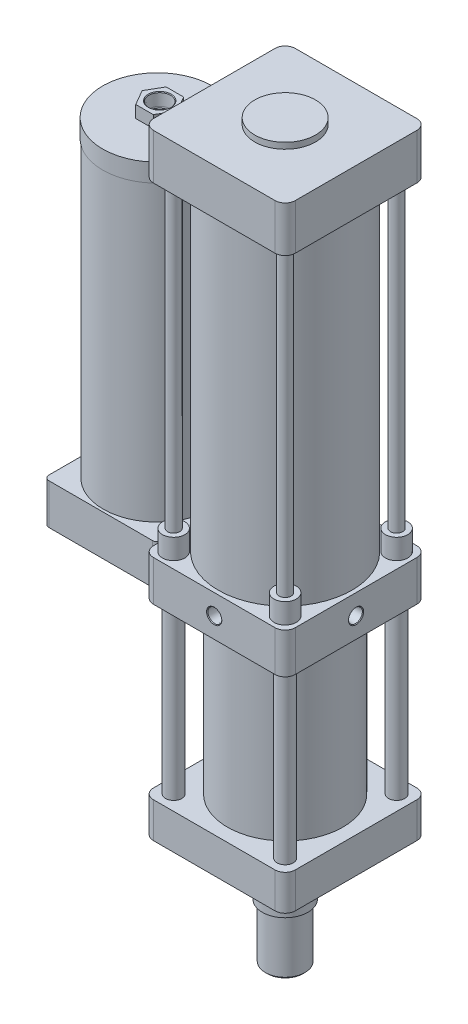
from build123d import *

# Parameters (mm, degrees)
SKETCH_1_R             = 8
EXTRUDE_1_DEPTH        = 35
SKETCH_2_R             = 32.5
EXTRUDE_2_DEPTH        = 22
SKETCH_3_R             = 57
EXTRUDE_3_DEPTH        = 167
SKETCH_4_R             = 8
EXTRUDE_4_DEPTH        = 40
SKETCH_5_R             = 11
EXTRUDE_5_DEPTH        = 20
SKETCH_6_R             = 66
EXTRUDE_6_DEPTH        = 320
EXTRUDE_7_DEPTH        = 45
SKETCH_8_R             = 30
EXTRUDE_8_DEPTH        = 6
SKETCH_9_R             = 6
EXTRUDE_9_DEPTH        = 300
SKETCH_10_R            = 8
EXTRUDE_10_DEPTH       = 202
EXTRUDE_10_2_DEPTH     = 202
EXTRUDE_10_3_DEPTH     = 202
EXTRUDE_10_4_DEPTH     = 202
EXTRUDE_11_DEPTH       = 40
SKETCH_12_R            = 53.5
EXTRUDE_12_DEPTH       = 290
SKETCH_13_R            = 54
EXTRUDE_13_DEPTH       = 18
EXTRUDE_14_DEPTH       = 12
SKETCH_23_R            = 22.5
EXTRUDE_15_DEPTH       = 33
SKETCH_24_R            = 19.5
EXTRUDE_16_DEPTH       = 55
CHAMFER_2_SIZE         = 2
F_1_2_NPT_4_AT_2_COUNT = 2
F_1_2_NPT_4_AT_2_PITCH = 362.5


with BuildPart() as part:
    # Sketch 1 → Extrude 1 (new body)
    with BuildSketch(Plane(origin=(0, 0, 0), x_dir=(1, 0, 0), z_dir=(0, 1, 0))):
        with BuildLine():
            Line((60, 70), (-60, 70))
            ThreePointArc((-60, 70), (-67.071067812, 67.071067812), (-70, 60))
            Line((-70, 60), (-70, -60))
            ThreePointArc((-70, -60), (-67.071067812, -67.071067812), (-60, -70))
            Line((-60, -70), (60, -70))
            ThreePointArc((60, -70), (67.071067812, -67.071067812), (70, -60))
            Line((70, -60), (70, 60))
            ThreePointArc((70, 60), (67.071067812, 67.071067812), (60, 70))
        make_face()
        with Locations(Location((55, -55, 0), (0, 0, 270))):
            Circle(SKETCH_1_R, mode=Mode.SUBTRACT)
        with Locations(Location((-55, -55, 0), (0, 0, 270))):
            Circle(SKETCH_1_R, mode=Mode.SUBTRACT)
        with Locations(Location((-55, 55, 0), (0, 0, 270))):
            Circle(SKETCH_1_R, mode=Mode.SUBTRACT)
        with Locations(Location((55, 55, 0), (0, 0, 270))):
            Circle(SKETCH_1_R, mode=Mode.SUBTRACT)
    extrude(amount=EXTRUDE_1_DEPTH)

    # Sketch 2 → Extrude 2 (add)
    with BuildSketch(Plane.XZ):
        with Locations(Location((0, 0, 0), (0, 0, 90))):
            Circle(SKETCH_2_R)
    extrude(amount=EXTRUDE_2_DEPTH)

    # Sketch 3 → Extrude 3 (add)
    with BuildSketch(Plane(origin=(0, 35, 0), x_dir=(1, 0, 0), z_dir=(0, 1, 0))):
        with Locations(Location((0, 0, 0), (0, 0, 90))):
            Circle(SKETCH_3_R)
    extrude(amount=EXTRUDE_3_DEPTH)

    # Sketch 4 → Extrude 4 (add)
    with BuildSketch(Plane(origin=(0, 202, 0), x_dir=(1, 0, 0), z_dir=(0, 1, 0))):
        with BuildLine():
            Line((-60, -70), (60, -70))
            ThreePointArc((60, -70), (67.071067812, -67.071067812), (70, -60))
            Line((70, -60), (70, 60))
            ThreePointArc((70, 60), (67.071067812, 67.071067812), (60, 70))
            Line((60, 70), (-60, 70))
            ThreePointArc((-60, 70), (-67.071067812, 67.071067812), (-70, 60))
            Line((-70, 60), (-70, -60))
            ThreePointArc((-70, -60), (-67.071067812, -67.071067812), (-60, -70))
        make_face()
        with Locations(Location((-55, -55, 0), (0, 0, 270))):
            Circle(SKETCH_4_R, mode=Mode.SUBTRACT)
        with Locations(Location((55, -55, 0), (0, 0, 270))):
            Circle(SKETCH_4_R, mode=Mode.SUBTRACT)
        with Locations(Location((55, 55, 0), (0, 0, 270))):
            Circle(SKETCH_4_R, mode=Mode.SUBTRACT)
        with Locations(Location((-55, 55, 0), (0, 0, 270))):
            Circle(SKETCH_4_R, mode=Mode.SUBTRACT)
    extrude(amount=EXTRUDE_4_DEPTH)

    # Sketch 5 → Extrude 5 (add)
    with BuildSketch(Plane(origin=(0, 242, 0), x_dir=(1, 0, 0), z_dir=(0, 1, 0))):
        with Locations(Location((-55, 55, 0), (0, 0, 270))):
            Circle(SKETCH_5_R)
        with Locations(Location((55, 55, 0), (0, 0, 270))):
            Circle(SKETCH_5_R)
        with Locations(Location((-55, -55, 0), (0, 0, 270))):
            Circle(SKETCH_5_R)
        with Locations(Location((55, -55, 0), (0, 0, 270))):
            Circle(SKETCH_5_R)
    extrude(amount=EXTRUDE_5_DEPTH)

    # Sketch 6 → Extrude 6 (add)
    with BuildSketch(Plane(origin=(0, 242, 0), x_dir=(1, 0, 0), z_dir=(0, 1, 0))):
        with Locations(Location((0, 0, 0), (0, 0, 270))):
            Circle(SKETCH_6_R)
    extrude(amount=EXTRUDE_6_DEPTH)

    # Sketch 7 → Extrude 7 (add)
    with BuildSketch(Plane(origin=(0, 562, 0), x_dir=(1, 0, 0), z_dir=(0, 1, 0))):
        with BuildLine():
            Line((-60, -70), (60, -70))
            ThreePointArc((60, -70), (67.071067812, -67.071067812), (70, -60))
            Line((70, -60), (70, 60))
            ThreePointArc((70, 60), (67.071067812, 67.071067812), (60, 70))
            Line((60, 70), (-60, 70))
            ThreePointArc((-60, 70), (-67.071067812, 67.071067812), (-70, 60))
            Line((-70, 60), (-70, -60))
            ThreePointArc((-70, -60), (-67.071067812, -67.071067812), (-60, -70))
        make_face()
    extrude(amount=EXTRUDE_7_DEPTH)

    # Sketch 8 → Extrude 8 (add)
    with BuildSketch(Plane(origin=(0, 607, 0), x_dir=(1, 0, 0), z_dir=(0, 1, 0))):
        with Locations(Location((0, 0, 0), (0, 0, 270))):
            Circle(SKETCH_8_R)
    extrude(amount=EXTRUDE_8_DEPTH)

    # Sketch 9 → Extrude 9 (add)
    with BuildSketch(Plane(origin=(0, 262, 0), x_dir=(1, 0, 0), z_dir=(0, 1, 0))):
        with Locations(Location((-55, 55, 0), (0, 0, 270))):
            Circle(SKETCH_9_R)
        with Locations(Location((-55, -55, 0), (0, 0, 270))):
            Circle(SKETCH_9_R)
        with Locations(Location((55, -55, 0), (0, 0, 270))):
            Circle(SKETCH_9_R)
        with Locations(Location((55, 55, 0), (0, 0, 270))):
            Circle(SKETCH_9_R)
    extrude(amount=EXTRUDE_9_DEPTH)

    # Sketch 20 → 1_4 NPT _1 (revolve, cut)
    with BuildSketch(Plane(origin=(0, 222, 70), x_dir=(0, -1, 0), z_dir=(1, 0, 0))):
        Polygon((0, 0), (0, 20.412347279), (5.5626, 17.07), (5.5626, 10.02), (6.576987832, 10.02), (6.8579873, 0.635), (7.4929873, 0), align=None)
    revolve(axis=Axis((0, 222, 76.35), (0, 0, -1)), mode=Mode.SUBTRACT)

    # Sketch 22 → 1_4 NPT _2 (revolve, cut)
    with BuildSketch(Plane(origin=(70, 222, 0), x_dir=(0, 0, -1), z_dir=(0, 1, 0))):
        Polygon((0, 0), (0, 20.412347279), (5.5626, 17.07), (5.5626, 10.02), (6.576987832, 10.02), (6.8579873, 0.635), (7.4929873, 0), align=None)
    revolve(axis=Axis((76.35, 222, 0), (-1, 0, 0)), mode=Mode.SUBTRACT)

    # Sketch 23 → Extrude 15 (add)
    with BuildSketch(Plane.XZ.offset(22)):
        with Locations(Location((0, 0, 0), (0, 0, 270))):
            Circle(SKETCH_23_R)
    extrude(amount=EXTRUDE_15_DEPTH)

    # Sketch 24 → Extrude 16 (add)
    with BuildSketch(Plane.XZ.offset(55)):
        with Locations(Location((0, 0, 0), (0, 0, 270))):
            Circle(SKETCH_24_R)
    extrude(amount=EXTRUDE_16_DEPTH)

    # Chamfer 2
    chamfer_2_edges = [part.edges().sort_by_distance(p)[0] for p in [
        (0, -110, 19.5),
    ]]
    chamfer(chamfer_2_edges, length=CHAMFER_2_SIZE)

    # Sketch 26 → 1_2 NPT _3 (revolve, cut)
    with BuildSketch(Plane(origin=(-70, 17.5, 0), x_dir=(0, 0, 1), z_dir=(0, 1, 0))):
        Polygon((0, 0), (0, 28.004543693), (8.9281, 22.64), (8.9281, 13.57), (10.280670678, 13.57), (10.6679619, 0.635), (11.3029619, 0), align=None)
    revolve(axis=Axis((-76.35, 17.5, 0), (1, 0, 0)), mode=Mode.SUBTRACT)

    # Sketch 28 → 1_2 NPT _4 (revolve, cut)
    with BuildSketch(Plane(origin=(0, 222, -70), x_dir=(0, 1, 0), z_dir=(1, 0, 0))):
        Polygon((0, 0), (0, 28.004543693), (8.9281, 22.64), (8.9281, 13.57), (10.280670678, 13.57), (10.6679619, 0.635), (11.3029619, 0), align=None)
    f_1_2_npt_4 = revolve(axis=Axis((0, 222, -76.35), (0, 0, 1)), mode=Mode.SUBTRACT)

    # 1_2 NPT _4 at 2: 1_2 NPT _4 ×2
    with Locations(*[(0, i * F_1_2_NPT_4_AT_2_PITCH, 0) for i in range(1, F_1_2_NPT_4_AT_2_COUNT)]):
        add(f_1_2_npt_4, mode=Mode.SUBTRACT)


with BuildPart() as body_2:
    # Sketch 10 → Extrude 10 (new body)
    with BuildSketch(Plane.XZ):
        with Locations(Location((55, -55, 0), (0, 0, 270))):
            Circle(SKETCH_10_R)
    extrude(amount=-EXTRUDE_10_DEPTH)


with BuildPart() as body_3:
    # Sketch 10 → Extrude 10 2 (new body)
    with BuildSketch(Plane.XZ):
        with Locations(Location((55, 55, 0), (0, 0, 270))):
            Circle(SKETCH_10_R)
    extrude(amount=-EXTRUDE_10_2_DEPTH)


with BuildPart() as body_4:
    # Sketch 10 → Extrude 10 3 (new body)
    with BuildSketch(Plane.XZ):
        with Locations(Location((-55, 55, 0), (0, 0, 270))):
            Circle(SKETCH_10_R)
    extrude(amount=-EXTRUDE_10_3_DEPTH)


with BuildPart() as body_5:
    # Sketch 10 → Extrude 10 4 (new body)
    with BuildSketch(Plane.XZ):
        with Locations(Location((-55, -55, 0), (0, 0, 270))):
            Circle(SKETCH_10_R)
    extrude(amount=-EXTRUDE_10_4_DEPTH)


with BuildPart() as body_6:
    # Sketch 11 → Extrude 11 (new body)
    with BuildSketch(Plane.XZ.offset(-202)):
        with BuildLine():
            Line((-177, 56), (-75, 56))
            ThreePointArc((-75, 56), (-71.464466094, 54.535533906), (-70, 51))
            Line((-70, 51), (-70, -51))
            ThreePointArc((-70, -51), (-71.464466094, -54.535533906), (-75, -56))
            Line((-75, -56), (-177, -56))
            ThreePointArc((-177, -56), (-180.535533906, -54.535533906), (-182, -51))
            Line((-182, -51), (-182, 51))
            ThreePointArc((-182, 51), (-180.535533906, 54.535533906), (-177, 56))
        make_face()
    extrude(amount=-EXTRUDE_11_DEPTH)


with BuildPart() as body_7:
    # Sketch 12 → Extrude 12 (new body)
    with BuildSketch(Plane(origin=(0, 242, 0), x_dir=(1, 0, 0), z_dir=(0, 1, 0))):
        with Locations(Location((-126, 0, 0), (0, 0, 270))):
            Circle(SKETCH_12_R)
    extrude(amount=EXTRUDE_12_DEPTH)


with BuildPart() as body_8:
    # Sketch 13 → Extrude 13 (new body)
    with BuildSketch(Plane(origin=(0, 532, 0), x_dir=(1, 0, 0), z_dir=(0, 1, 0))):
        with Locations(Location((-126, 0, 0), (0, 0, 270))):
            Circle(SKETCH_13_R)
    extrude(amount=EXTRUDE_13_DEPTH)


with BuildPart() as body_9:
    # Sketch 14 → Extrude 14 (new body)
    with BuildSketch(Plane(origin=(0, 550, 0), x_dir=(1, 0, 0), z_dir=(0, 1, 0))):
        Polygon((-144.465223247, 3.368745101), (-135.804969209, -11.631254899), (-118.484461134, -11.631254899), (-109.824207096, 3.368745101), (-118.484461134, 18.368745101), (-135.804969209, 18.368745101), align=None)
    extrude(amount=EXTRUDE_14_DEPTH)


with BuildPart() as f_1_2_npt_1_tool:
    # Sketch 16 → 1_2 NPT _1 (revolve)
    with BuildSketch(Plane(origin=(-127.144715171, 562, -3.368745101), x_dir=(0, 0, 1), z_dir=(1, 0, 0))):
        Polygon((0, 0), (0, 28.004543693), (8.9281, 22.64), (8.9281, 13.57), (10.280670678, 13.57), (10.6679619, 0.635), (11.3029619, 0), align=None)
    revolve(axis=Axis((-127.144715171, 568.35, -3.368745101), (0, -1, 0)))


with BuildPart() as body_8_1:
    add(body_8.part)

    # 1_2 NPT _1: cut by f_1_2_npt_1_tool
    add(f_1_2_npt_1_tool.part, mode=Mode.SUBTRACT)


with BuildPart() as body_9_1:
    add(body_9.part)

    # 1_2 NPT _1: cut by f_1_2_npt_1_tool
    add(f_1_2_npt_1_tool.part, mode=Mode.SUBTRACT)


solid = Compound([part.part, body_2.part, body_3.part, body_4.part, body_5.part, body_6.part, body_7.part, body_8_1.part, body_9_1.part])
